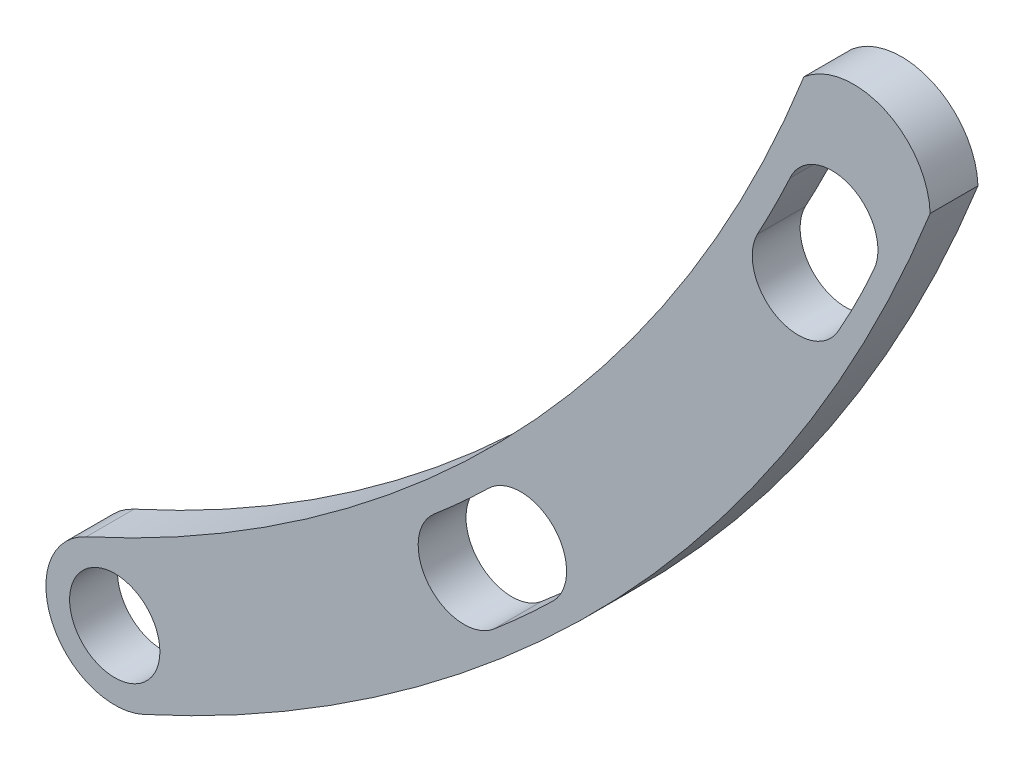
from build123d import *

# Parameters (mm, degrees)
SKETCH1_R              = 1.4986
EXTRUDE1_DEPTH         = 1.5875
ADJUSTMENT_SLOTS_DEPTH = 27.781218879
CUT_EXTRUDE2_DEPTH     = 27.781218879


with BuildPart() as part:
    # Sketch1 → Extrude1 (new body)
    with BuildSketch(Plane.XY):
        with BuildLine():
            ThreePointArc((16.23761146, 18.648579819), (14.25936874, 21.205560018), (11.70238854, 19.227317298))
            ThreePointArc((11.70238854, 19.227317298), (3.083277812, -2.274448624), (-14.9158769, -16.856815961))
            ThreePointArc((-14.9158769, -16.856815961), (-16.051132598, -19.883825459), (-13.0241231, -21.019081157))
            ThreePointArc((-13.0241231, -21.019081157), (6.762533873, -4.988533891), (16.23761146, 18.648579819))
        make_face()
        with Locations((13.97, 18.937948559)):
            Circle(SKETCH1_R, mode=Mode.SUBTRACT)
        with Locations((-13.97, -18.937948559)):
            Circle(SKETCH1_R, mode=Mode.SUBTRACT)
    extrude(amount=EXTRUDE1_DEPTH)

    # Sketch5 → Adjustment Slots (cut, through all)
    with BuildSketch(Plane.XY.offset(1.5875)):
        with BuildLine():
            ThreePointArc((0.568687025, -10.967305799), (0.597062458, -8.812231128), (-1.558012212, -8.783855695))
            ThreePointArc((-1.558012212, -8.783855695), (-2.444534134, -9.618085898), (-3.359245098, -10.421307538))
            ThreePointArc((-3.359245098, -10.421307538), (-3.535821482, -12.569323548), (-1.387805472, -12.745899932))
            ThreePointArc((-1.387805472, -12.745899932), (-0.394249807, -11.873443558), (0.568687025, -10.967305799))
        make_face()
        with BuildLine():
            ThreePointArc((8.443643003, 5.134276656), (10.450347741, 5.920589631), (11.236660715, 3.913884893))
            ThreePointArc((11.236660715, 3.913884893), (10.670674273, 2.705525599), (10.042411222, 1.528343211))
            ThreePointArc((10.042411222, 1.528343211), (7.991074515, 0.940795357), (7.363032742, 2.980098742))
            ThreePointArc((7.363032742, 2.980098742), (7.920352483, 4.048652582), (8.443643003, 5.134276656))
        make_face()
    extrude(amount=-ADJUSTMENT_SLOTS_DEPTH, mode=Mode.SUBTRACT)

    # Sketch4 → Cut-Extrude2 (cut, through all)
    with BuildSketch(Plane.XY.offset(1.5875)):
        with BuildLine():
            Line((16.508944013, -84.170540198), (13.099135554, 6.445510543))
            ThreePointArc((13.099135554, 6.445510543), (11.578024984, 8.677471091), (8.906792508, 8.277543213))
            Line((8.906792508, 8.277543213), (-59.908156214, -50.77665459))
            Line((-59.908156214, -50.77665459), (12.714036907, 115.408780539))
            Line((12.714036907, 115.408780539), (89.131137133, 82.014894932))
            Line((89.131137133, 82.014894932), (16.508944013, -84.170540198))
        make_face()
    extrude(amount=-CUT_EXTRUDE2_DEPTH, mode=Mode.SUBTRACT)


solid = part.part
